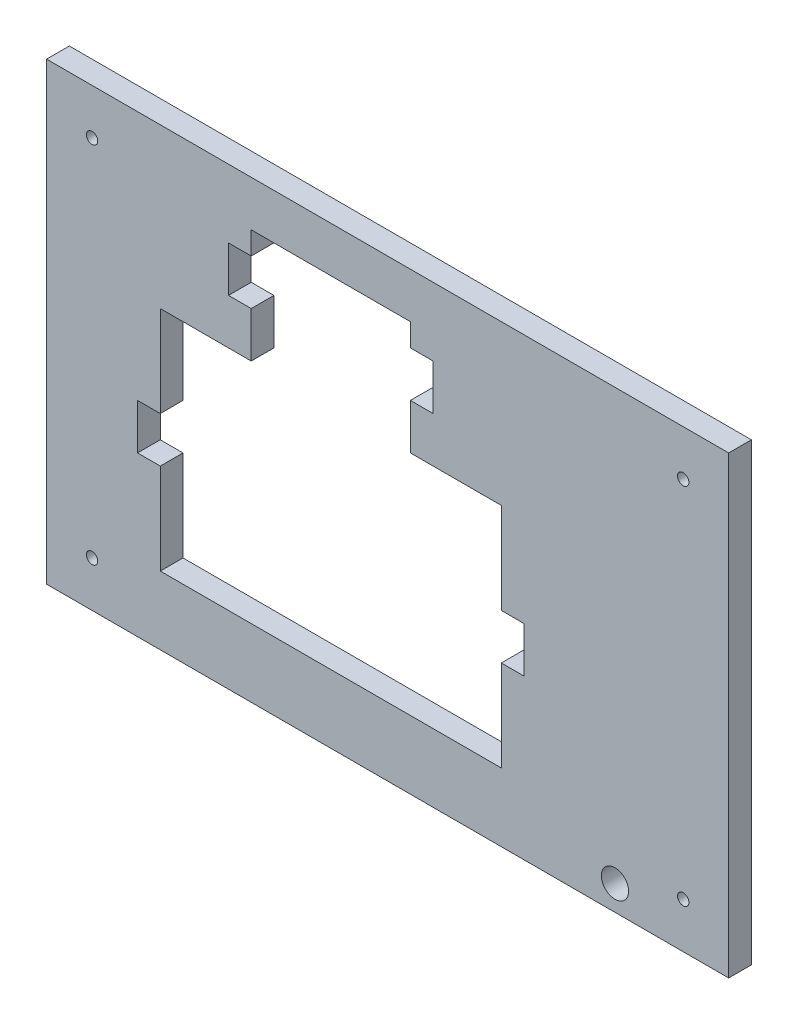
ISO-10303-21;
HEADER;
FILE_DESCRIPTION(('STEP AP214'),'2;1');
FILE_NAME('part.step','',(''),(''),'','','');
FILE_SCHEMA(('AUTOMOTIVE_DESIGN { 1 0 10303 214 1 1 1 1 }'));
ENDSEC;
DATA;
#1=APPLICATION_CONTEXT('core data for automotive mechanical design processes');
#2=APPLICATION_PROTOCOL_DEFINITION('international standard','automotive_design',2000,#1);
#3=PRODUCT_CONTEXT('',#1,'mechanical');
#4=PRODUCT('Part','Part','',(#3));
#5=PRODUCT_RELATED_PRODUCT_CATEGORY('part','',(#4));
#6=PRODUCT_DEFINITION_FORMATION('','',#4);
#7=PRODUCT_DEFINITION_CONTEXT('part definition',#1,'design');
#8=PRODUCT_DEFINITION('design','',#6,#7);
#9=PRODUCT_DEFINITION_SHAPE('','',#8);
#10=(LENGTH_UNIT() NAMED_UNIT(*) SI_UNIT(.MILLI.,.METRE.));
#11=(NAMED_UNIT(*) PLANE_ANGLE_UNIT() SI_UNIT($,.RADIAN.));
#12=(NAMED_UNIT(*) SI_UNIT($,.STERADIAN.) SOLID_ANGLE_UNIT());
#13=UNCERTAINTY_MEASURE_WITH_UNIT(LENGTH_MEASURE(1.E-05),#10,'distance_accuracy_value','');
#14=(GEOMETRIC_REPRESENTATION_CONTEXT(3) GLOBAL_UNCERTAINTY_ASSIGNED_CONTEXT((#13)) GLOBAL_UNIT_ASSIGNED_CONTEXT((#10,
#11,#12)) REPRESENTATION_CONTEXT('',''));
#15=CARTESIAN_POINT('',(0.,0.,0.));
#16=DIRECTION('',(0.,0.,1.));
#17=DIRECTION('',(1.,0.,0.));
#18=AXIS2_PLACEMENT_3D('',#15,#16,#17);
#19=CARTESIAN_POINT('',(0.,0.,-10.));
#20=DIRECTION('',(-1.,0.,0.));
#21=DIRECTION('',(0.,0.,1.));
#22=AXIS2_PLACEMENT_3D('',#19,#20,#21);
#23=PLANE('',#22);
#24=DIRECTION('',(0.,-1.,0.));
#25=VECTOR('',#24,1.);
#26=CARTESIAN_POINT('',(0.,0.,0.));
#27=LINE('',#26,#25);
#28=CARTESIAN_POINT('',(0.,200.,0.));
#29=VERTEX_POINT('',#28);
#30=CARTESIAN_POINT('',(0.,0.,0.));
#31=VERTEX_POINT('',#30);
#32=EDGE_CURVE('E366',#29,#31,#27,.T.);
#33=ORIENTED_EDGE('',*,*,#32,.F.);
#34=DIRECTION('',(0.,0.,1.));
#35=VECTOR('',#34,1.);
#36=CARTESIAN_POINT('',(0.,200.,-10.));
#37=LINE('',#36,#35);
#38=CARTESIAN_POINT('',(0.,200.,-10.));
#39=VERTEX_POINT('',#38);
#40=EDGE_CURVE('E11',#39,#29,#37,.T.);
#41=ORIENTED_EDGE('',*,*,#40,.F.);
#42=DIRECTION('',(0.,-1.,0.));
#43=VECTOR('',#42,1.);
#44=CARTESIAN_POINT('',(0.,0.,-10.));
#45=LINE('',#44,#43);
#46=CARTESIAN_POINT('',(0.,0.,-10.));
#47=VERTEX_POINT('',#46);
#48=EDGE_CURVE('E420',#39,#47,#45,.T.);
#49=ORIENTED_EDGE('',*,*,#48,.T.);
#50=DIRECTION('',(0.,0.,1.));
#51=VECTOR('',#50,1.);
#52=CARTESIAN_POINT('',(0.,0.,-10.));
#53=LINE('',#52,#51);
#54=EDGE_CURVE('E29',#47,#31,#53,.T.);
#55=ORIENTED_EDGE('',*,*,#54,.T.);
#56=EDGE_LOOP('',(#33,#41,#49,#55));
#57=FACE_BOUND('',#56,.T.);
#58=ADVANCED_FACE('F26',(#57),#23,.T.);
#59=CARTESIAN_POINT('',(0.,200.,-10.));
#60=DIRECTION('',(0.,1.,0.));
#61=DIRECTION('',(0.,0.,1.));
#62=AXIS2_PLACEMENT_3D('',#59,#60,#61);
#63=PLANE('',#62);
#64=DIRECTION('',(-1.,0.,0.));
#65=VECTOR('',#64,1.);
#66=CARTESIAN_POINT('',(0.,200.,0.));
#67=LINE('',#66,#65);
#68=CARTESIAN_POINT('',(300.,200.,0.));
#69=VERTEX_POINT('',#68);
#70=EDGE_CURVE('E417',#69,#29,#67,.T.);
#71=ORIENTED_EDGE('',*,*,#70,.F.);
#72=DIRECTION('',(0.,0.,1.));
#73=VECTOR('',#72,1.);
#74=CARTESIAN_POINT('',(300.,200.,-10.));
#75=LINE('',#74,#73);
#76=CARTESIAN_POINT('',(300.,200.,-10.));
#77=VERTEX_POINT('',#76);
#78=EDGE_CURVE('E34',#77,#69,#75,.T.);
#79=ORIENTED_EDGE('',*,*,#78,.F.);
#80=DIRECTION('',(-1.,0.,0.));
#81=VECTOR('',#80,1.);
#82=CARTESIAN_POINT('',(0.,200.,-10.));
#83=LINE('',#82,#81);
#84=EDGE_CURVE('E429',#77,#39,#83,.T.);
#85=ORIENTED_EDGE('',*,*,#84,.T.);
#86=ORIENTED_EDGE('',*,*,#40,.T.);
#87=EDGE_LOOP('',(#71,#79,#85,#86));
#88=FACE_BOUND('',#87,.T.);
#89=ADVANCED_FACE('F443',(#88),#63,.T.);
#90=CARTESIAN_POINT('',(300.,0.,-10.));
#91=DIRECTION('',(1.,0.,0.));
#92=DIRECTION('',(0.,0.,-1.));
#93=AXIS2_PLACEMENT_3D('',#90,#91,#92);
#94=PLANE('',#93);
#95=DIRECTION('',(0.,1.,0.));
#96=VECTOR('',#95,1.);
#97=CARTESIAN_POINT('',(300.,0.,0.));
#98=LINE('',#97,#96);
#99=CARTESIAN_POINT('',(300.,0.,0.));
#100=VERTEX_POINT('',#99);
#101=EDGE_CURVE('E414',#100,#69,#98,.T.);
#102=ORIENTED_EDGE('',*,*,#101,.F.);
#103=DIRECTION('',(0.,0.,1.));
#104=VECTOR('',#103,1.);
#105=CARTESIAN_POINT('',(300.,0.,-10.));
#106=LINE('',#105,#104);
#107=CARTESIAN_POINT('',(300.,0.,-10.));
#108=VERTEX_POINT('',#107);
#109=EDGE_CURVE('E432',#108,#100,#106,.T.);
#110=ORIENTED_EDGE('',*,*,#109,.F.);
#111=DIRECTION('',(0.,1.,0.));
#112=VECTOR('',#111,1.);
#113=CARTESIAN_POINT('',(300.,0.,-10.));
#114=LINE('',#113,#112);
#115=EDGE_CURVE('E426',#108,#77,#114,.T.);
#116=ORIENTED_EDGE('',*,*,#115,.T.);
#117=ORIENTED_EDGE('',*,*,#78,.T.);
#118=EDGE_LOOP('',(#102,#110,#116,#117));
#119=FACE_BOUND('',#118,.T.);
#120=ADVANCED_FACE('F449',(#119),#94,.T.);
#121=CARTESIAN_POINT('',(0.,0.,-10.));
#122=DIRECTION('',(0.,-1.,0.));
#123=DIRECTION('',(0.,0.,-1.));
#124=AXIS2_PLACEMENT_3D('',#121,#122,#123);
#125=PLANE('',#124);
#126=DIRECTION('',(1.,0.,0.));
#127=VECTOR('',#126,1.);
#128=CARTESIAN_POINT('',(0.,0.,0.));
#129=LINE('',#128,#127);
#130=EDGE_CURVE('E411',#31,#100,#129,.T.);
#131=ORIENTED_EDGE('',*,*,#130,.F.);
#132=ORIENTED_EDGE('',*,*,#54,.F.);
#133=DIRECTION('',(1.,0.,0.));
#134=VECTOR('',#133,1.);
#135=CARTESIAN_POINT('',(0.,0.,-10.));
#136=LINE('',#135,#134);
#137=EDGE_CURVE('E423',#47,#108,#136,.T.);
#138=ORIENTED_EDGE('',*,*,#137,.T.);
#139=ORIENTED_EDGE('',*,*,#109,.T.);
#140=EDGE_LOOP('',(#131,#132,#138,#139));
#141=FACE_BOUND('',#140,.T.);
#142=ADVANCED_FACE('F440',(#141),#125,.T.);
#143=CARTESIAN_POINT('',(0.,200.,-10.));
#144=DIRECTION('',(0.,0.,-1.));
#145=DIRECTION('',(-1.,0.,0.));
#146=AXIS2_PLACEMENT_3D('',#143,#144,#145);
#147=PLANE('',#146);
#148=CARTESIAN_POINT('',(250.,11.,-10.));
#149=DIRECTION('',(0.,0.,-1.));
#150=DIRECTION('',(-1.,0.,0.));
#151=AXIS2_PLACEMENT_3D('',#148,#149,#150);
#152=CIRCLE('',#151,6.00000000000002);
#153=CARTESIAN_POINT('',(244.,11.,-10.));
#154=VERTEX_POINT('',#153);
#155=EDGE_CURVE('E719',#154,#154,#152,.T.);
#156=ORIENTED_EDGE('',*,*,#155,.F.);
#157=EDGE_LOOP('',(#156));
#158=FACE_BOUND('',#157,.T.);
#159=CARTESIAN_POINT('',(20.,20.,-10.));
#160=DIRECTION('',(0.,0.,-1.));
#161=DIRECTION('',(-1.,0.,0.));
#162=AXIS2_PLACEMENT_3D('',#159,#160,#161);
#163=CIRCLE('',#162,2.50000000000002);
#164=CARTESIAN_POINT('',(17.4999999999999,20.,-10.));
#165=VERTEX_POINT('',#164);
#166=EDGE_CURVE('E721',#165,#165,#163,.T.);
#167=ORIENTED_EDGE('',*,*,#166,.F.);
#168=EDGE_LOOP('',(#167));
#169=FACE_BOUND('',#168,.T.);
#170=CARTESIAN_POINT('',(20.,180.,-10.));
#171=DIRECTION('',(0.,0.,-1.));
#172=DIRECTION('',(-1.,0.,0.));
#173=AXIS2_PLACEMENT_3D('',#170,#171,#172);
#174=CIRCLE('',#173,2.50000000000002);
#175=CARTESIAN_POINT('',(17.4999999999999,180.,-10.));
#176=VERTEX_POINT('',#175);
#177=EDGE_CURVE('E729',#176,#176,#174,.T.);
#178=ORIENTED_EDGE('',*,*,#177,.F.);
#179=EDGE_LOOP('',(#178));
#180=FACE_BOUND('',#179,.T.);
#181=CARTESIAN_POINT('',(280.,20.,-10.));
#182=DIRECTION('',(0.,0.,-1.));
#183=DIRECTION('',(-1.,0.,0.));
#184=AXIS2_PLACEMENT_3D('',#181,#182,#183);
#185=CIRCLE('',#184,2.50000000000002);
#186=CARTESIAN_POINT('',(277.5,20.,-10.));
#187=VERTEX_POINT('',#186);
#188=EDGE_CURVE('E735',#187,#187,#185,.T.);
#189=ORIENTED_EDGE('',*,*,#188,.F.);
#190=EDGE_LOOP('',(#189));
#191=FACE_BOUND('',#190,.T.);
#192=CARTESIAN_POINT('',(280.,180.,-10.));
#193=DIRECTION('',(0.,0.,-1.));
#194=DIRECTION('',(-1.,0.,0.));
#195=AXIS2_PLACEMENT_3D('',#192,#193,#194);
#196=CIRCLE('',#195,2.50000000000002);
#197=CARTESIAN_POINT('',(277.5,180.,-10.));
#198=VERTEX_POINT('',#197);
#199=EDGE_CURVE('E741',#198,#198,#196,.T.);
#200=ORIENTED_EDGE('',*,*,#199,.F.);
#201=EDGE_LOOP('',(#200));
#202=FACE_BOUND('',#201,.T.);
#203=DIRECTION('',(0.,1.,0.));
#204=VECTOR('',#203,1.);
#205=CARTESIAN_POINT('',(200.,30.,-10.));
#206=LINE('',#205,#204);
#207=CARTESIAN_POINT('',(200.,30.,-10.));
#208=VERTEX_POINT('',#207);
#209=CARTESIAN_POINT('',(200.,70.,-10.));
#210=VERTEX_POINT('',#209);
#211=EDGE_CURVE('E295',#208,#210,#206,.T.);
#212=ORIENTED_EDGE('',*,*,#211,.T.);
#213=DIRECTION('',(1.,0.,0.));
#214=VECTOR('',#213,1.);
#215=CARTESIAN_POINT('',(200.,70.,-10.));
#216=LINE('',#215,#214);
#217=CARTESIAN_POINT('',(210.,70.,-10.));
#218=VERTEX_POINT('',#217);
#219=EDGE_CURVE('E298',#210,#218,#216,.T.);
#220=ORIENTED_EDGE('',*,*,#219,.T.);
#221=DIRECTION('',(0.,1.,0.));
#222=VECTOR('',#221,1.);
#223=CARTESIAN_POINT('',(210.,70.,-10.));
#224=LINE('',#223,#222);
#225=CARTESIAN_POINT('',(210.,90.,-10.));
#226=VERTEX_POINT('',#225);
#227=EDGE_CURVE('E42',#218,#226,#224,.T.);
#228=ORIENTED_EDGE('',*,*,#227,.T.);
#229=DIRECTION('',(-1.,0.,0.));
#230=VECTOR('',#229,1.);
#231=CARTESIAN_POINT('',(210.,90.,-10.));
#232=LINE('',#231,#230);
#233=CARTESIAN_POINT('',(200.,90.,-10.));
#234=VERTEX_POINT('',#233);
#235=EDGE_CURVE('E301',#226,#234,#232,.T.);
#236=ORIENTED_EDGE('',*,*,#235,.T.);
#237=DIRECTION('',(0.,1.,0.));
#238=VECTOR('',#237,1.);
#239=CARTESIAN_POINT('',(200.,90.,-10.));
#240=LINE('',#239,#238);
#241=CARTESIAN_POINT('',(200.,130.,-10.));
#242=VERTEX_POINT('',#241);
#243=EDGE_CURVE('E304',#234,#242,#240,.T.);
#244=ORIENTED_EDGE('',*,*,#243,.T.);
#245=DIRECTION('',(-1.,0.,0.));
#246=VECTOR('',#245,1.);
#247=CARTESIAN_POINT('',(200.,130.,-10.));
#248=LINE('',#247,#246);
#249=CARTESIAN_POINT('',(160.,130.,-10.));
#250=VERTEX_POINT('',#249);
#251=EDGE_CURVE('E307',#242,#250,#248,.T.);
#252=ORIENTED_EDGE('',*,*,#251,.T.);
#253=DIRECTION('',(0.,1.,0.));
#254=VECTOR('',#253,1.);
#255=CARTESIAN_POINT('',(160.,130.,-10.));
#256=LINE('',#255,#254);
#257=CARTESIAN_POINT('',(160.,150.,-10.));
#258=VERTEX_POINT('',#257);
#259=EDGE_CURVE('E310',#250,#258,#256,.T.);
#260=ORIENTED_EDGE('',*,*,#259,.T.);
#261=DIRECTION('',(1.,0.,0.));
#262=VECTOR('',#261,1.);
#263=CARTESIAN_POINT('',(160.,150.,-10.));
#264=LINE('',#263,#262);
#265=CARTESIAN_POINT('',(170.,150.,-10.));
#266=VERTEX_POINT('',#265);
#267=EDGE_CURVE('E313',#258,#266,#264,.T.);
#268=ORIENTED_EDGE('',*,*,#267,.T.);
#269=DIRECTION('',(0.,1.,0.));
#270=VECTOR('',#269,1.);
#271=CARTESIAN_POINT('',(170.,150.,-10.));
#272=LINE('',#271,#270);
#273=CARTESIAN_POINT('',(170.,170.,-10.));
#274=VERTEX_POINT('',#273);
#275=EDGE_CURVE('E316',#266,#274,#272,.T.);
#276=ORIENTED_EDGE('',*,*,#275,.T.);
#277=DIRECTION('',(-1.,0.,0.));
#278=VECTOR('',#277,1.);
#279=CARTESIAN_POINT('',(170.,170.,-10.));
#280=LINE('',#279,#278);
#281=CARTESIAN_POINT('',(160.,170.,-10.));
#282=VERTEX_POINT('',#281);
#283=EDGE_CURVE('E319',#274,#282,#280,.T.);
#284=ORIENTED_EDGE('',*,*,#283,.T.);
#285=DIRECTION('',(0.,1.,0.));
#286=VECTOR('',#285,1.);
#287=CARTESIAN_POINT('',(160.,170.,-10.));
#288=LINE('',#287,#286);
#289=CARTESIAN_POINT('',(160.,180.,-10.));
#290=VERTEX_POINT('',#289);
#291=EDGE_CURVE('E322',#282,#290,#288,.T.);
#292=ORIENTED_EDGE('',*,*,#291,.T.);
#293=DIRECTION('',(-1.,0.,0.));
#294=VECTOR('',#293,1.);
#295=CARTESIAN_POINT('',(160.,180.,-10.));
#296=LINE('',#295,#294);
#297=CARTESIAN_POINT('',(90.,180.,-10.));
#298=VERTEX_POINT('',#297);
#299=EDGE_CURVE('E325',#290,#298,#296,.T.);
#300=ORIENTED_EDGE('',*,*,#299,.T.);
#301=DIRECTION('',(0.,-1.,0.));
#302=VECTOR('',#301,1.);
#303=CARTESIAN_POINT('',(90.,170.,-10.));
#304=LINE('',#303,#302);
#305=CARTESIAN_POINT('',(90.,170.,-10.));
#306=VERTEX_POINT('',#305);
#307=EDGE_CURVE('E328',#298,#306,#304,.T.);
#308=ORIENTED_EDGE('',*,*,#307,.T.);
#309=DIRECTION('',(-1.,0.,0.));
#310=VECTOR('',#309,1.);
#311=CARTESIAN_POINT('',(80.,170.,-10.));
#312=LINE('',#311,#310);
#313=CARTESIAN_POINT('',(80.,170.,-10.));
#314=VERTEX_POINT('',#313);
#315=EDGE_CURVE('E331',#306,#314,#312,.T.);
#316=ORIENTED_EDGE('',*,*,#315,.T.);
#317=DIRECTION('',(0.,-1.,0.));
#318=VECTOR('',#317,1.);
#319=CARTESIAN_POINT('',(80.,150.,-10.));
#320=LINE('',#319,#318);
#321=CARTESIAN_POINT('',(80.,150.,-10.));
#322=VERTEX_POINT('',#321);
#323=EDGE_CURVE('E334',#314,#322,#320,.T.);
#324=ORIENTED_EDGE('',*,*,#323,.T.);
#325=DIRECTION('',(1.,0.,0.));
#326=VECTOR('',#325,1.);
#327=CARTESIAN_POINT('',(90.,150.,-10.));
#328=LINE('',#327,#326);
#329=CARTESIAN_POINT('',(90.,150.,-10.));
#330=VERTEX_POINT('',#329);
#331=EDGE_CURVE('E337',#322,#330,#328,.T.);
#332=ORIENTED_EDGE('',*,*,#331,.T.);
#333=DIRECTION('',(0.,-1.,0.));
#334=VECTOR('',#333,1.);
#335=CARTESIAN_POINT('',(90.,130.,-10.));
#336=LINE('',#335,#334);
#337=CARTESIAN_POINT('',(90.,130.,-10.));
#338=VERTEX_POINT('',#337);
#339=EDGE_CURVE('E340',#330,#338,#336,.T.);
#340=ORIENTED_EDGE('',*,*,#339,.T.);
#341=DIRECTION('',(-1.,0.,0.));
#342=VECTOR('',#341,1.);
#343=CARTESIAN_POINT('',(50.,130.,-10.));
#344=LINE('',#343,#342);
#345=CARTESIAN_POINT('',(50.,130.,-10.));
#346=VERTEX_POINT('',#345);
#347=EDGE_CURVE('E343',#338,#346,#344,.T.);
#348=ORIENTED_EDGE('',*,*,#347,.T.);
#349=DIRECTION('',(0.,-1.,0.));
#350=VECTOR('',#349,1.);
#351=CARTESIAN_POINT('',(50.,90.,-10.));
#352=LINE('',#351,#350);
#353=CARTESIAN_POINT('',(50.,90.,-10.));
#354=VERTEX_POINT('',#353);
#355=EDGE_CURVE('E346',#346,#354,#352,.T.);
#356=ORIENTED_EDGE('',*,*,#355,.T.);
#357=DIRECTION('',(-1.,0.,0.));
#358=VECTOR('',#357,1.);
#359=CARTESIAN_POINT('',(40.,90.,-10.));
#360=LINE('',#359,#358);
#361=CARTESIAN_POINT('',(40.,90.,-10.));
#362=VERTEX_POINT('',#361);
#363=EDGE_CURVE('E349',#354,#362,#360,.T.);
#364=ORIENTED_EDGE('',*,*,#363,.T.);
#365=DIRECTION('',(0.,-1.,0.));
#366=VECTOR('',#365,1.);
#367=CARTESIAN_POINT('',(40.,70.,-10.));
#368=LINE('',#367,#366);
#369=CARTESIAN_POINT('',(40.,70.,-10.));
#370=VERTEX_POINT('',#369);
#371=EDGE_CURVE('E352',#362,#370,#368,.T.);
#372=ORIENTED_EDGE('',*,*,#371,.T.);
#373=DIRECTION('',(1.,0.,0.));
#374=VECTOR('',#373,1.);
#375=CARTESIAN_POINT('',(50.,70.,-10.));
#376=LINE('',#375,#374);
#377=CARTESIAN_POINT('',(50.,70.,-10.));
#378=VERTEX_POINT('',#377);
#379=EDGE_CURVE('E355',#370,#378,#376,.T.);
#380=ORIENTED_EDGE('',*,*,#379,.T.);
#381=DIRECTION('',(0.,-1.,0.));
#382=VECTOR('',#381,1.);
#383=CARTESIAN_POINT('',(50.,30.,-10.));
#384=LINE('',#383,#382);
#385=CARTESIAN_POINT('',(50.,30.,-10.));
#386=VERTEX_POINT('',#385);
#387=EDGE_CURVE('E358',#378,#386,#384,.T.);
#388=ORIENTED_EDGE('',*,*,#387,.T.);
#389=DIRECTION('',(1.,0.,0.));
#390=VECTOR('',#389,1.);
#391=CARTESIAN_POINT('',(50.,30.,-10.));
#392=LINE('',#391,#390);
#393=EDGE_CURVE('E361',#386,#208,#392,.T.);
#394=ORIENTED_EDGE('',*,*,#393,.T.);
#395=EDGE_LOOP('',(#212,#220,#228,#236,#244,#252,#260,#268,#276,#284,#292,#300,#308,#316,#324,
#332,#340,#348,#356,#364,#372,#380,#388,#394));
#396=FACE_BOUND('',#395,.T.);
#397=ORIENTED_EDGE('',*,*,#48,.F.);
#398=ORIENTED_EDGE('',*,*,#84,.F.);
#399=ORIENTED_EDGE('',*,*,#115,.F.);
#400=ORIENTED_EDGE('',*,*,#137,.F.);
#401=EDGE_LOOP('',(#397,#398,#399,#400));
#402=FACE_BOUND('',#401,.T.);
#403=ADVANCED_FACE('F446',(#158,#169,#180,#191,#202,#396,#402),#147,.T.);
#404=CARTESIAN_POINT('',(0.,200.,0.));
#405=DIRECTION('',(0.,0.,-1.));
#406=DIRECTION('',(-1.,0.,0.));
#407=AXIS2_PLACEMENT_3D('',#404,#405,#406);
#408=PLANE('',#407);
#409=CARTESIAN_POINT('',(250.,11.,0.));
#410=DIRECTION('',(0.,0.,-1.));
#411=DIRECTION('',(-1.,0.,0.));
#412=AXIS2_PLACEMENT_3D('',#409,#410,#411);
#413=CIRCLE('',#412,6.00000000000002);
#414=CARTESIAN_POINT('',(244.,11.,0.));
#415=VERTEX_POINT('',#414);
#416=EDGE_CURVE('E716',#415,#415,#413,.T.);
#417=ORIENTED_EDGE('',*,*,#416,.T.);
#418=EDGE_LOOP('',(#417));
#419=FACE_BOUND('',#418,.T.);
#420=CARTESIAN_POINT('',(20.,20.,0.));
#421=DIRECTION('',(0.,0.,-1.));
#422=DIRECTION('',(-1.,0.,0.));
#423=AXIS2_PLACEMENT_3D('',#420,#421,#422);
#424=CIRCLE('',#423,2.50000000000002);
#425=CARTESIAN_POINT('',(17.4999999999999,20.,0.));
#426=VERTEX_POINT('',#425);
#427=EDGE_CURVE('E726',#426,#426,#424,.T.);
#428=ORIENTED_EDGE('',*,*,#427,.T.);
#429=EDGE_LOOP('',(#428));
#430=FACE_BOUND('',#429,.T.);
#431=CARTESIAN_POINT('',(20.,180.,0.));
#432=DIRECTION('',(0.,0.,-1.));
#433=DIRECTION('',(-1.,0.,0.));
#434=AXIS2_PLACEMENT_3D('',#431,#432,#433);
#435=CIRCLE('',#434,2.50000000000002);
#436=CARTESIAN_POINT('',(17.4999999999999,180.,0.));
#437=VERTEX_POINT('',#436);
#438=EDGE_CURVE('E732',#437,#437,#435,.T.);
#439=ORIENTED_EDGE('',*,*,#438,.T.);
#440=EDGE_LOOP('',(#439));
#441=FACE_BOUND('',#440,.T.);
#442=CARTESIAN_POINT('',(280.,20.,0.));
#443=DIRECTION('',(0.,0.,-1.));
#444=DIRECTION('',(-1.,0.,0.));
#445=AXIS2_PLACEMENT_3D('',#442,#443,#444);
#446=CIRCLE('',#445,2.50000000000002);
#447=CARTESIAN_POINT('',(277.5,20.,0.));
#448=VERTEX_POINT('',#447);
#449=EDGE_CURVE('E738',#448,#448,#446,.T.);
#450=ORIENTED_EDGE('',*,*,#449,.T.);
#451=EDGE_LOOP('',(#450));
#452=FACE_BOUND('',#451,.T.);
#453=CARTESIAN_POINT('',(280.,180.,0.));
#454=DIRECTION('',(0.,0.,-1.));
#455=DIRECTION('',(-1.,0.,0.));
#456=AXIS2_PLACEMENT_3D('',#453,#454,#455);
#457=CIRCLE('',#456,2.50000000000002);
#458=CARTESIAN_POINT('',(277.5,180.,0.));
#459=VERTEX_POINT('',#458);
#460=EDGE_CURVE('E744',#459,#459,#457,.T.);
#461=ORIENTED_EDGE('',*,*,#460,.T.);
#462=EDGE_LOOP('',(#461));
#463=FACE_BOUND('',#462,.T.);
#464=DIRECTION('',(1.,0.,0.));
#465=VECTOR('',#464,1.);
#466=CARTESIAN_POINT('',(200.,70.,0.));
#467=LINE('',#466,#465);
#468=CARTESIAN_POINT('',(200.,70.,0.));
#469=VERTEX_POINT('',#468);
#470=CARTESIAN_POINT('',(210.,70.,0.));
#471=VERTEX_POINT('',#470);
#472=EDGE_CURVE('E222',#469,#471,#467,.T.);
#473=ORIENTED_EDGE('',*,*,#472,.F.);
#474=DIRECTION('',(0.,1.,0.));
#475=VECTOR('',#474,1.);
#476=CARTESIAN_POINT('',(200.,30.,0.));
#477=LINE('',#476,#475);
#478=CARTESIAN_POINT('',(200.,30.,0.));
#479=VERTEX_POINT('',#478);
#480=EDGE_CURVE('E50',#479,#469,#477,.T.);
#481=ORIENTED_EDGE('',*,*,#480,.F.);
#482=DIRECTION('',(1.,0.,0.));
#483=VECTOR('',#482,1.);
#484=CARTESIAN_POINT('',(50.,30.,0.));
#485=LINE('',#484,#483);
#486=CARTESIAN_POINT('',(50.,30.,0.));
#487=VERTEX_POINT('',#486);
#488=EDGE_CURVE('E292',#487,#479,#485,.T.);
#489=ORIENTED_EDGE('',*,*,#488,.F.);
#490=DIRECTION('',(0.,-1.,0.));
#491=VECTOR('',#490,1.);
#492=CARTESIAN_POINT('',(50.,30.,0.));
#493=LINE('',#492,#491);
#494=CARTESIAN_POINT('',(50.,70.,0.));
#495=VERTEX_POINT('',#494);
#496=EDGE_CURVE('E289',#495,#487,#493,.T.);
#497=ORIENTED_EDGE('',*,*,#496,.F.);
#498=DIRECTION('',(1.,0.,0.));
#499=VECTOR('',#498,1.);
#500=CARTESIAN_POINT('',(50.,70.,0.));
#501=LINE('',#500,#499);
#502=CARTESIAN_POINT('',(40.,70.,0.));
#503=VERTEX_POINT('',#502);
#504=EDGE_CURVE('E286',#503,#495,#501,.T.);
#505=ORIENTED_EDGE('',*,*,#504,.F.);
#506=DIRECTION('',(0.,-1.,0.));
#507=VECTOR('',#506,1.);
#508=CARTESIAN_POINT('',(40.,70.,0.));
#509=LINE('',#508,#507);
#510=CARTESIAN_POINT('',(40.,90.,0.));
#511=VERTEX_POINT('',#510);
#512=EDGE_CURVE('E283',#511,#503,#509,.T.);
#513=ORIENTED_EDGE('',*,*,#512,.F.);
#514=DIRECTION('',(-1.,0.,0.));
#515=VECTOR('',#514,1.);
#516=CARTESIAN_POINT('',(40.,90.,0.));
#517=LINE('',#516,#515);
#518=CARTESIAN_POINT('',(50.,90.,0.));
#519=VERTEX_POINT('',#518);
#520=EDGE_CURVE('E280',#519,#511,#517,.T.);
#521=ORIENTED_EDGE('',*,*,#520,.F.);
#522=DIRECTION('',(0.,-1.,0.));
#523=VECTOR('',#522,1.);
#524=CARTESIAN_POINT('',(50.,90.,0.));
#525=LINE('',#524,#523);
#526=CARTESIAN_POINT('',(50.,130.,0.));
#527=VERTEX_POINT('',#526);
#528=EDGE_CURVE('E277',#527,#519,#525,.T.);
#529=ORIENTED_EDGE('',*,*,#528,.F.);
#530=DIRECTION('',(-1.,0.,0.));
#531=VECTOR('',#530,1.);
#532=CARTESIAN_POINT('',(50.,130.,0.));
#533=LINE('',#532,#531);
#534=CARTESIAN_POINT('',(90.,130.,0.));
#535=VERTEX_POINT('',#534);
#536=EDGE_CURVE('E274',#535,#527,#533,.T.);
#537=ORIENTED_EDGE('',*,*,#536,.F.);
#538=DIRECTION('',(0.,-1.,0.));
#539=VECTOR('',#538,1.);
#540=CARTESIAN_POINT('',(90.,130.,0.));
#541=LINE('',#540,#539);
#542=CARTESIAN_POINT('',(90.,150.,0.));
#543=VERTEX_POINT('',#542);
#544=EDGE_CURVE('E271',#543,#535,#541,.T.);
#545=ORIENTED_EDGE('',*,*,#544,.F.);
#546=DIRECTION('',(1.,0.,0.));
#547=VECTOR('',#546,1.);
#548=CARTESIAN_POINT('',(90.,150.,0.));
#549=LINE('',#548,#547);
#550=CARTESIAN_POINT('',(80.,150.,0.));
#551=VERTEX_POINT('',#550);
#552=EDGE_CURVE('E268',#551,#543,#549,.T.);
#553=ORIENTED_EDGE('',*,*,#552,.F.);
#554=DIRECTION('',(0.,-1.,0.));
#555=VECTOR('',#554,1.);
#556=CARTESIAN_POINT('',(80.,150.,0.));
#557=LINE('',#556,#555);
#558=CARTESIAN_POINT('',(80.,170.,0.));
#559=VERTEX_POINT('',#558);
#560=EDGE_CURVE('E265',#559,#551,#557,.T.);
#561=ORIENTED_EDGE('',*,*,#560,.F.);
#562=DIRECTION('',(-1.,0.,0.));
#563=VECTOR('',#562,1.);
#564=CARTESIAN_POINT('',(80.,170.,0.));
#565=LINE('',#564,#563);
#566=CARTESIAN_POINT('',(90.,170.,0.));
#567=VERTEX_POINT('',#566);
#568=EDGE_CURVE('E262',#567,#559,#565,.T.);
#569=ORIENTED_EDGE('',*,*,#568,.F.);
#570=DIRECTION('',(0.,-1.,0.));
#571=VECTOR('',#570,1.);
#572=CARTESIAN_POINT('',(90.,170.,0.));
#573=LINE('',#572,#571);
#574=CARTESIAN_POINT('',(90.,180.,0.));
#575=VERTEX_POINT('',#574);
#576=EDGE_CURVE('E259',#575,#567,#573,.T.);
#577=ORIENTED_EDGE('',*,*,#576,.F.);
#578=DIRECTION('',(-1.,0.,0.));
#579=VECTOR('',#578,1.);
#580=CARTESIAN_POINT('',(160.,180.,0.));
#581=LINE('',#580,#579);
#582=CARTESIAN_POINT('',(160.,180.,0.));
#583=VERTEX_POINT('',#582);
#584=EDGE_CURVE('E256',#583,#575,#581,.T.);
#585=ORIENTED_EDGE('',*,*,#584,.F.);
#586=DIRECTION('',(0.,1.,0.));
#587=VECTOR('',#586,1.);
#588=CARTESIAN_POINT('',(160.,170.,0.));
#589=LINE('',#588,#587);
#590=CARTESIAN_POINT('',(160.,170.,0.));
#591=VERTEX_POINT('',#590);
#592=EDGE_CURVE('E253',#591,#583,#589,.T.);
#593=ORIENTED_EDGE('',*,*,#592,.F.);
#594=DIRECTION('',(-1.,0.,0.));
#595=VECTOR('',#594,1.);
#596=CARTESIAN_POINT('',(170.,170.,0.));
#597=LINE('',#596,#595);
#598=CARTESIAN_POINT('',(170.,170.,0.));
#599=VERTEX_POINT('',#598);
#600=EDGE_CURVE('E250',#599,#591,#597,.T.);
#601=ORIENTED_EDGE('',*,*,#600,.F.);
#602=DIRECTION('',(0.,1.,0.));
#603=VECTOR('',#602,1.);
#604=CARTESIAN_POINT('',(170.,150.,0.));
#605=LINE('',#604,#603);
#606=CARTESIAN_POINT('',(170.,150.,0.));
#607=VERTEX_POINT('',#606);
#608=EDGE_CURVE('E247',#607,#599,#605,.T.);
#609=ORIENTED_EDGE('',*,*,#608,.F.);
#610=DIRECTION('',(1.,0.,0.));
#611=VECTOR('',#610,1.);
#612=CARTESIAN_POINT('',(160.,150.,0.));
#613=LINE('',#612,#611);
#614=CARTESIAN_POINT('',(160.,150.,0.));
#615=VERTEX_POINT('',#614);
#616=EDGE_CURVE('E244',#615,#607,#613,.T.);
#617=ORIENTED_EDGE('',*,*,#616,.F.);
#618=DIRECTION('',(0.,1.,0.));
#619=VECTOR('',#618,1.);
#620=CARTESIAN_POINT('',(160.,130.,0.));
#621=LINE('',#620,#619);
#622=CARTESIAN_POINT('',(160.,130.,0.));
#623=VERTEX_POINT('',#622);
#624=EDGE_CURVE('E241',#623,#615,#621,.T.);
#625=ORIENTED_EDGE('',*,*,#624,.F.);
#626=DIRECTION('',(-1.,0.,0.));
#627=VECTOR('',#626,1.);
#628=CARTESIAN_POINT('',(200.,130.,0.));
#629=LINE('',#628,#627);
#630=CARTESIAN_POINT('',(200.,130.,0.));
#631=VERTEX_POINT('',#630);
#632=EDGE_CURVE('E238',#631,#623,#629,.T.);
#633=ORIENTED_EDGE('',*,*,#632,.F.);
#634=DIRECTION('',(0.,1.,0.));
#635=VECTOR('',#634,1.);
#636=CARTESIAN_POINT('',(200.,90.,0.));
#637=LINE('',#636,#635);
#638=CARTESIAN_POINT('',(200.,90.,0.));
#639=VERTEX_POINT('',#638);
#640=EDGE_CURVE('E232',#639,#631,#637,.T.);
#641=ORIENTED_EDGE('',*,*,#640,.F.);
#642=DIRECTION('',(-1.,0.,0.));
#643=VECTOR('',#642,1.);
#644=CARTESIAN_POINT('',(210.,90.,0.));
#645=LINE('',#644,#643);
#646=CARTESIAN_POINT('',(210.,90.,0.));
#647=VERTEX_POINT('',#646);
#648=EDGE_CURVE('E230',#647,#639,#645,.T.);
#649=ORIENTED_EDGE('',*,*,#648,.F.);
#650=DIRECTION('',(0.,1.,0.));
#651=VECTOR('',#650,1.);
#652=CARTESIAN_POINT('',(210.,70.,0.));
#653=LINE('',#652,#651);
#654=EDGE_CURVE('E213',#471,#647,#653,.T.);
#655=ORIENTED_EDGE('',*,*,#654,.F.);
#656=EDGE_LOOP('',(#473,#481,#489,#497,#505,#513,#521,#529,#537,#545,#553,#561,#569,#577,#585,
#593,#601,#609,#617,#625,#633,#641,#649,#655));
#657=FACE_BOUND('',#656,.T.);
#658=ORIENTED_EDGE('',*,*,#32,.T.);
#659=ORIENTED_EDGE('',*,*,#130,.T.);
#660=ORIENTED_EDGE('',*,*,#101,.T.);
#661=ORIENTED_EDGE('',*,*,#70,.T.);
#662=EDGE_LOOP('',(#658,#659,#660,#661));
#663=FACE_BOUND('',#662,.T.);
#664=ADVANCED_FACE('F226',(#419,#430,#441,#452,#463,#657,#663),#408,.F.);
#665=CARTESIAN_POINT('',(200.,30.,-10.));
#666=DIRECTION('',(1.,0.,0.));
#667=DIRECTION('',(0.,0.,-1.));
#668=AXIS2_PLACEMENT_3D('',#665,#666,#667);
#669=PLANE('',#668);
#670=ORIENTED_EDGE('',*,*,#480,.T.);
#671=DIRECTION('',(0.,0.,1.));
#672=VECTOR('',#671,1.);
#673=CARTESIAN_POINT('',(200.,70.,-10.));
#674=LINE('',#673,#672);
#675=EDGE_CURVE('E219',#210,#469,#674,.T.);
#676=ORIENTED_EDGE('',*,*,#675,.F.);
#677=ORIENTED_EDGE('',*,*,#211,.F.);
#678=DIRECTION('',(0.,0.,1.));
#679=VECTOR('',#678,1.);
#680=CARTESIAN_POINT('',(200.,30.,-10.));
#681=LINE('',#680,#679);
#682=EDGE_CURVE('E364',#208,#479,#681,.T.);
#683=ORIENTED_EDGE('',*,*,#682,.T.);
#684=EDGE_LOOP('',(#670,#676,#677,#683));
#685=FACE_BOUND('',#684,.T.);
#686=ADVANCED_FACE('F486',(#685),#669,.F.);
#687=CARTESIAN_POINT('',(50.,30.,-10.));
#688=DIRECTION('',(0.,-1.,0.));
#689=DIRECTION('',(0.,0.,-1.));
#690=AXIS2_PLACEMENT_3D('',#687,#688,#689);
#691=PLANE('',#690);
#692=ORIENTED_EDGE('',*,*,#488,.T.);
#693=ORIENTED_EDGE('',*,*,#682,.F.);
#694=ORIENTED_EDGE('',*,*,#393,.F.);
#695=DIRECTION('',(0.,0.,1.));
#696=VECTOR('',#695,1.);
#697=CARTESIAN_POINT('',(50.,30.,-10.));
#698=LINE('',#697,#696);
#699=EDGE_CURVE('E367',#386,#487,#698,.T.);
#700=ORIENTED_EDGE('',*,*,#699,.T.);
#701=EDGE_LOOP('',(#692,#693,#694,#700));
#702=FACE_BOUND('',#701,.T.);
#703=ADVANCED_FACE('F494',(#702),#691,.F.);
#704=CARTESIAN_POINT('',(50.,30.,-10.));
#705=DIRECTION('',(-1.,0.,0.));
#706=DIRECTION('',(0.,-1.,0.));
#707=AXIS2_PLACEMENT_3D('',#704,#705,#706);
#708=PLANE('',#707);
#709=ORIENTED_EDGE('',*,*,#496,.T.);
#710=ORIENTED_EDGE('',*,*,#699,.F.);
#711=ORIENTED_EDGE('',*,*,#387,.F.);
#712=DIRECTION('',(0.,0.,1.));
#713=VECTOR('',#712,1.);
#714=CARTESIAN_POINT('',(50.,70.,-10.));
#715=LINE('',#714,#713);
#716=EDGE_CURVE('E369',#378,#495,#715,.T.);
#717=ORIENTED_EDGE('',*,*,#716,.T.);
#718=EDGE_LOOP('',(#709,#710,#711,#717));
#719=FACE_BOUND('',#718,.T.);
#720=ADVANCED_FACE('F501',(#719),#708,.F.);
#721=CARTESIAN_POINT('',(50.,70.,-10.));
#722=DIRECTION('',(0.,-1.,0.));
#723=DIRECTION('',(0.,0.,-1.));
#724=AXIS2_PLACEMENT_3D('',#721,#722,#723);
#725=PLANE('',#724);
#726=ORIENTED_EDGE('',*,*,#504,.T.);
#727=ORIENTED_EDGE('',*,*,#716,.F.);
#728=ORIENTED_EDGE('',*,*,#379,.F.);
#729=DIRECTION('',(0.,0.,1.));
#730=VECTOR('',#729,1.);
#731=CARTESIAN_POINT('',(40.,70.,-10.));
#732=LINE('',#731,#730);
#733=EDGE_CURVE('E371',#370,#503,#732,.T.);
#734=ORIENTED_EDGE('',*,*,#733,.T.);
#735=EDGE_LOOP('',(#726,#727,#728,#734));
#736=FACE_BOUND('',#735,.T.);
#737=ADVANCED_FACE('F509',(#736),#725,.F.);
#738=CARTESIAN_POINT('',(40.,70.,-10.));
#739=DIRECTION('',(-1.,0.,0.));
#740=DIRECTION('',(0.,0.,1.));
#741=AXIS2_PLACEMENT_3D('',#738,#739,#740);
#742=PLANE('',#741);
#743=ORIENTED_EDGE('',*,*,#512,.T.);
#744=ORIENTED_EDGE('',*,*,#733,.F.);
#745=ORIENTED_EDGE('',*,*,#371,.F.);
#746=DIRECTION('',(0.,0.,1.));
#747=VECTOR('',#746,1.);
#748=CARTESIAN_POINT('',(40.,90.,-10.));
#749=LINE('',#748,#747);
#750=EDGE_CURVE('E373',#362,#511,#749,.T.);
#751=ORIENTED_EDGE('',*,*,#750,.T.);
#752=EDGE_LOOP('',(#743,#744,#745,#751));
#753=FACE_BOUND('',#752,.T.);
#754=ADVANCED_FACE('F517',(#753),#742,.F.);
#755=CARTESIAN_POINT('',(40.,90.,-10.));
#756=DIRECTION('',(0.,1.,0.));
#757=DIRECTION('',(0.,0.,1.));
#758=AXIS2_PLACEMENT_3D('',#755,#756,#757);
#759=PLANE('',#758);
#760=ORIENTED_EDGE('',*,*,#520,.T.);
#761=ORIENTED_EDGE('',*,*,#750,.F.);
#762=ORIENTED_EDGE('',*,*,#363,.F.);
#763=DIRECTION('',(0.,0.,1.));
#764=VECTOR('',#763,1.);
#765=CARTESIAN_POINT('',(50.,90.,-10.));
#766=LINE('',#765,#764);
#767=EDGE_CURVE('E375',#354,#519,#766,.T.);
#768=ORIENTED_EDGE('',*,*,#767,.T.);
#769=EDGE_LOOP('',(#760,#761,#762,#768));
#770=FACE_BOUND('',#769,.T.);
#771=ADVANCED_FACE('F525',(#770),#759,.F.);
#772=CARTESIAN_POINT('',(50.,90.,-10.));
#773=DIRECTION('',(-1.,0.,0.));
#774=DIRECTION('',(0.,0.,1.));
#775=AXIS2_PLACEMENT_3D('',#772,#773,#774);
#776=PLANE('',#775);
#777=ORIENTED_EDGE('',*,*,#528,.T.);
#778=ORIENTED_EDGE('',*,*,#767,.F.);
#779=ORIENTED_EDGE('',*,*,#355,.F.);
#780=DIRECTION('',(0.,0.,1.));
#781=VECTOR('',#780,1.);
#782=CARTESIAN_POINT('',(50.,130.,-10.));
#783=LINE('',#782,#781);
#784=EDGE_CURVE('E377',#346,#527,#783,.T.);
#785=ORIENTED_EDGE('',*,*,#784,.T.);
#786=EDGE_LOOP('',(#777,#778,#779,#785));
#787=FACE_BOUND('',#786,.T.);
#788=ADVANCED_FACE('F533',(#787),#776,.F.);
#789=CARTESIAN_POINT('',(50.,130.,-10.));
#790=DIRECTION('',(0.,1.,0.));
#791=DIRECTION('',(-1.,0.,0.));
#792=AXIS2_PLACEMENT_3D('',#789,#790,#791);
#793=PLANE('',#792);
#794=ORIENTED_EDGE('',*,*,#536,.T.);
#795=ORIENTED_EDGE('',*,*,#784,.F.);
#796=ORIENTED_EDGE('',*,*,#347,.F.);
#797=DIRECTION('',(0.,0.,1.));
#798=VECTOR('',#797,1.);
#799=CARTESIAN_POINT('',(90.,130.,-10.));
#800=LINE('',#799,#798);
#801=EDGE_CURVE('E379',#338,#535,#800,.T.);
#802=ORIENTED_EDGE('',*,*,#801,.T.);
#803=EDGE_LOOP('',(#794,#795,#796,#802));
#804=FACE_BOUND('',#803,.T.);
#805=ADVANCED_FACE('F541',(#804),#793,.F.);
#806=CARTESIAN_POINT('',(90.,130.,-10.));
#807=DIRECTION('',(-1.,0.,0.));
#808=DIRECTION('',(0.,0.,1.));
#809=AXIS2_PLACEMENT_3D('',#806,#807,#808);
#810=PLANE('',#809);
#811=ORIENTED_EDGE('',*,*,#544,.T.);
#812=ORIENTED_EDGE('',*,*,#801,.F.);
#813=ORIENTED_EDGE('',*,*,#339,.F.);
#814=DIRECTION('',(0.,0.,1.));
#815=VECTOR('',#814,1.);
#816=CARTESIAN_POINT('',(90.,150.,-10.));
#817=LINE('',#816,#815);
#818=EDGE_CURVE('E381',#330,#543,#817,.T.);
#819=ORIENTED_EDGE('',*,*,#818,.T.);
#820=EDGE_LOOP('',(#811,#812,#813,#819));
#821=FACE_BOUND('',#820,.T.);
#822=ADVANCED_FACE('F549',(#821),#810,.F.);
#823=CARTESIAN_POINT('',(90.,150.,-10.));
#824=DIRECTION('',(0.,-1.,0.));
#825=DIRECTION('',(0.,0.,-1.));
#826=AXIS2_PLACEMENT_3D('',#823,#824,#825);
#827=PLANE('',#826);
#828=ORIENTED_EDGE('',*,*,#552,.T.);
#829=ORIENTED_EDGE('',*,*,#818,.F.);
#830=ORIENTED_EDGE('',*,*,#331,.F.);
#831=DIRECTION('',(0.,0.,1.));
#832=VECTOR('',#831,1.);
#833=CARTESIAN_POINT('',(80.,150.,-10.));
#834=LINE('',#833,#832);
#835=EDGE_CURVE('E383',#322,#551,#834,.T.);
#836=ORIENTED_EDGE('',*,*,#835,.T.);
#837=EDGE_LOOP('',(#828,#829,#830,#836));
#838=FACE_BOUND('',#837,.T.);
#839=ADVANCED_FACE('F557',(#838),#827,.F.);
#840=CARTESIAN_POINT('',(80.,150.,-10.));
#841=DIRECTION('',(-1.,0.,0.));
#842=DIRECTION('',(0.,0.,1.));
#843=AXIS2_PLACEMENT_3D('',#840,#841,#842);
#844=PLANE('',#843);
#845=ORIENTED_EDGE('',*,*,#560,.T.);
#846=ORIENTED_EDGE('',*,*,#835,.F.);
#847=ORIENTED_EDGE('',*,*,#323,.F.);
#848=DIRECTION('',(0.,0.,1.));
#849=VECTOR('',#848,1.);
#850=CARTESIAN_POINT('',(80.,170.,-10.));
#851=LINE('',#850,#849);
#852=EDGE_CURVE('E385',#314,#559,#851,.T.);
#853=ORIENTED_EDGE('',*,*,#852,.T.);
#854=EDGE_LOOP('',(#845,#846,#847,#853));
#855=FACE_BOUND('',#854,.T.);
#856=ADVANCED_FACE('F565',(#855),#844,.F.);
#857=CARTESIAN_POINT('',(80.,170.,-10.));
#858=DIRECTION('',(0.,1.,0.));
#859=DIRECTION('',(0.,0.,1.));
#860=AXIS2_PLACEMENT_3D('',#857,#858,#859);
#861=PLANE('',#860);
#862=ORIENTED_EDGE('',*,*,#568,.T.);
#863=ORIENTED_EDGE('',*,*,#852,.F.);
#864=ORIENTED_EDGE('',*,*,#315,.F.);
#865=DIRECTION('',(0.,0.,1.));
#866=VECTOR('',#865,1.);
#867=CARTESIAN_POINT('',(90.,170.,-10.));
#868=LINE('',#867,#866);
#869=EDGE_CURVE('E387',#306,#567,#868,.T.);
#870=ORIENTED_EDGE('',*,*,#869,.T.);
#871=EDGE_LOOP('',(#862,#863,#864,#870));
#872=FACE_BOUND('',#871,.T.);
#873=ADVANCED_FACE('F573',(#872),#861,.F.);
#874=CARTESIAN_POINT('',(90.,170.,-10.));
#875=DIRECTION('',(-1.,0.,0.));
#876=DIRECTION('',(0.,-1.,0.));
#877=AXIS2_PLACEMENT_3D('',#874,#875,#876);
#878=PLANE('',#877);
#879=ORIENTED_EDGE('',*,*,#576,.T.);
#880=ORIENTED_EDGE('',*,*,#869,.F.);
#881=ORIENTED_EDGE('',*,*,#307,.F.);
#882=DIRECTION('',(0.,0.,1.));
#883=VECTOR('',#882,1.);
#884=CARTESIAN_POINT('',(90.,180.,-10.));
#885=LINE('',#884,#883);
#886=EDGE_CURVE('E389',#298,#575,#885,.T.);
#887=ORIENTED_EDGE('',*,*,#886,.T.);
#888=EDGE_LOOP('',(#879,#880,#881,#887));
#889=FACE_BOUND('',#888,.T.);
#890=ADVANCED_FACE('F581',(#889),#878,.F.);
#891=CARTESIAN_POINT('',(160.,180.,-10.));
#892=DIRECTION('',(0.,1.,0.));
#893=DIRECTION('',(0.,0.,1.));
#894=AXIS2_PLACEMENT_3D('',#891,#892,#893);
#895=PLANE('',#894);
#896=ORIENTED_EDGE('',*,*,#584,.T.);
#897=ORIENTED_EDGE('',*,*,#886,.F.);
#898=ORIENTED_EDGE('',*,*,#299,.F.);
#899=DIRECTION('',(0.,0.,1.));
#900=VECTOR('',#899,1.);
#901=CARTESIAN_POINT('',(160.,180.,-10.));
#902=LINE('',#901,#900);
#903=EDGE_CURVE('E391',#290,#583,#902,.T.);
#904=ORIENTED_EDGE('',*,*,#903,.T.);
#905=EDGE_LOOP('',(#896,#897,#898,#904));
#906=FACE_BOUND('',#905,.T.);
#907=ADVANCED_FACE('F589',(#906),#895,.F.);
#908=CARTESIAN_POINT('',(160.,170.,-10.));
#909=DIRECTION('',(1.,0.,0.));
#910=DIRECTION('',(0.,1.,0.));
#911=AXIS2_PLACEMENT_3D('',#908,#909,#910);
#912=PLANE('',#911);
#913=ORIENTED_EDGE('',*,*,#592,.T.);
#914=ORIENTED_EDGE('',*,*,#903,.F.);
#915=ORIENTED_EDGE('',*,*,#291,.F.);
#916=DIRECTION('',(0.,0.,1.));
#917=VECTOR('',#916,1.);
#918=CARTESIAN_POINT('',(160.,170.,-10.));
#919=LINE('',#918,#917);
#920=EDGE_CURVE('E393',#282,#591,#919,.T.);
#921=ORIENTED_EDGE('',*,*,#920,.T.);
#922=EDGE_LOOP('',(#913,#914,#915,#921));
#923=FACE_BOUND('',#922,.T.);
#924=ADVANCED_FACE('F597',(#923),#912,.F.);
#925=CARTESIAN_POINT('',(170.,170.,-10.));
#926=DIRECTION('',(0.,1.,0.));
#927=DIRECTION('',(0.,0.,1.));
#928=AXIS2_PLACEMENT_3D('',#925,#926,#927);
#929=PLANE('',#928);
#930=ORIENTED_EDGE('',*,*,#600,.T.);
#931=ORIENTED_EDGE('',*,*,#920,.F.);
#932=ORIENTED_EDGE('',*,*,#283,.F.);
#933=DIRECTION('',(0.,0.,1.));
#934=VECTOR('',#933,1.);
#935=CARTESIAN_POINT('',(170.,170.,-10.));
#936=LINE('',#935,#934);
#937=EDGE_CURVE('E395',#274,#599,#936,.T.);
#938=ORIENTED_EDGE('',*,*,#937,.T.);
#939=EDGE_LOOP('',(#930,#931,#932,#938));
#940=FACE_BOUND('',#939,.T.);
#941=ADVANCED_FACE('F605',(#940),#929,.F.);
#942=CARTESIAN_POINT('',(170.,150.,-10.));
#943=DIRECTION('',(1.,0.,0.));
#944=DIRECTION('',(0.,0.,-1.));
#945=AXIS2_PLACEMENT_3D('',#942,#943,#944);
#946=PLANE('',#945);
#947=ORIENTED_EDGE('',*,*,#608,.T.);
#948=ORIENTED_EDGE('',*,*,#937,.F.);
#949=ORIENTED_EDGE('',*,*,#275,.F.);
#950=DIRECTION('',(0.,0.,1.));
#951=VECTOR('',#950,1.);
#952=CARTESIAN_POINT('',(170.,150.,-10.));
#953=LINE('',#952,#951);
#954=EDGE_CURVE('E397',#266,#607,#953,.T.);
#955=ORIENTED_EDGE('',*,*,#954,.T.);
#956=EDGE_LOOP('',(#947,#948,#949,#955));
#957=FACE_BOUND('',#956,.T.);
#958=ADVANCED_FACE('F613',(#957),#946,.F.);
#959=CARTESIAN_POINT('',(160.,150.,-10.));
#960=DIRECTION('',(0.,-1.,0.));
#961=DIRECTION('',(0.,0.,-1.));
#962=AXIS2_PLACEMENT_3D('',#959,#960,#961);
#963=PLANE('',#962);
#964=ORIENTED_EDGE('',*,*,#616,.T.);
#965=ORIENTED_EDGE('',*,*,#954,.F.);
#966=ORIENTED_EDGE('',*,*,#267,.F.);
#967=DIRECTION('',(0.,0.,1.));
#968=VECTOR('',#967,1.);
#969=CARTESIAN_POINT('',(160.,150.,-10.));
#970=LINE('',#969,#968);
#971=EDGE_CURVE('E399',#258,#615,#970,.T.);
#972=ORIENTED_EDGE('',*,*,#971,.T.);
#973=EDGE_LOOP('',(#964,#965,#966,#972));
#974=FACE_BOUND('',#973,.T.);
#975=ADVANCED_FACE('F621',(#974),#963,.F.);
#976=CARTESIAN_POINT('',(160.,130.,-10.));
#977=DIRECTION('',(1.,0.,0.));
#978=DIRECTION('',(0.,0.,-1.));
#979=AXIS2_PLACEMENT_3D('',#976,#977,#978);
#980=PLANE('',#979);
#981=ORIENTED_EDGE('',*,*,#624,.T.);
#982=ORIENTED_EDGE('',*,*,#971,.F.);
#983=ORIENTED_EDGE('',*,*,#259,.F.);
#984=DIRECTION('',(0.,0.,1.));
#985=VECTOR('',#984,1.);
#986=CARTESIAN_POINT('',(160.,130.,-10.));
#987=LINE('',#986,#985);
#988=EDGE_CURVE('E401',#250,#623,#987,.T.);
#989=ORIENTED_EDGE('',*,*,#988,.T.);
#990=EDGE_LOOP('',(#981,#982,#983,#989));
#991=FACE_BOUND('',#990,.T.);
#992=ADVANCED_FACE('F629',(#991),#980,.F.);
#993=CARTESIAN_POINT('',(200.,130.,-10.));
#994=DIRECTION('',(0.,1.,0.));
#995=DIRECTION('',(0.,0.,1.));
#996=AXIS2_PLACEMENT_3D('',#993,#994,#995);
#997=PLANE('',#996);
#998=ORIENTED_EDGE('',*,*,#632,.T.);
#999=ORIENTED_EDGE('',*,*,#988,.F.);
#1000=ORIENTED_EDGE('',*,*,#251,.F.);
#1001=DIRECTION('',(0.,0.,1.));
#1002=VECTOR('',#1001,1.);
#1003=CARTESIAN_POINT('',(200.,130.,-10.));
#1004=LINE('',#1003,#1002);
#1005=EDGE_CURVE('E403',#242,#631,#1004,.T.);
#1006=ORIENTED_EDGE('',*,*,#1005,.T.);
#1007=EDGE_LOOP('',(#998,#999,#1000,#1006));
#1008=FACE_BOUND('',#1007,.T.);
#1009=ADVANCED_FACE('F637',(#1008),#997,.F.);
#1010=CARTESIAN_POINT('',(200.,90.,-10.));
#1011=DIRECTION('',(1.,0.,0.));
#1012=DIRECTION('',(0.,0.,-1.));
#1013=AXIS2_PLACEMENT_3D('',#1010,#1011,#1012);
#1014=PLANE('',#1013);
#1015=ORIENTED_EDGE('',*,*,#640,.T.);
#1016=ORIENTED_EDGE('',*,*,#1005,.F.);
#1017=ORIENTED_EDGE('',*,*,#243,.F.);
#1018=DIRECTION('',(0.,0.,1.));
#1019=VECTOR('',#1018,1.);
#1020=CARTESIAN_POINT('',(200.,90.,-10.));
#1021=LINE('',#1020,#1019);
#1022=EDGE_CURVE('E405',#234,#639,#1021,.T.);
#1023=ORIENTED_EDGE('',*,*,#1022,.T.);
#1024=EDGE_LOOP('',(#1015,#1016,#1017,#1023));
#1025=FACE_BOUND('',#1024,.T.);
#1026=ADVANCED_FACE('F645',(#1025),#1014,.F.);
#1027=CARTESIAN_POINT('',(210.,90.,-10.));
#1028=DIRECTION('',(0.,1.,0.));
#1029=DIRECTION('',(0.,0.,1.));
#1030=AXIS2_PLACEMENT_3D('',#1027,#1028,#1029);
#1031=PLANE('',#1030);
#1032=ORIENTED_EDGE('',*,*,#648,.T.);
#1033=ORIENTED_EDGE('',*,*,#1022,.F.);
#1034=ORIENTED_EDGE('',*,*,#235,.F.);
#1035=DIRECTION('',(0.,0.,1.));
#1036=VECTOR('',#1035,1.);
#1037=CARTESIAN_POINT('',(210.,90.,-10.));
#1038=LINE('',#1037,#1036);
#1039=EDGE_CURVE('E218',#226,#647,#1038,.T.);
#1040=ORIENTED_EDGE('',*,*,#1039,.T.);
#1041=EDGE_LOOP('',(#1032,#1033,#1034,#1040));
#1042=FACE_BOUND('',#1041,.T.);
#1043=ADVANCED_FACE('F653',(#1042),#1031,.F.);
#1044=CARTESIAN_POINT('',(210.,70.,-10.));
#1045=DIRECTION('',(1.,0.,0.));
#1046=DIRECTION('',(0.,0.,-1.));
#1047=AXIS2_PLACEMENT_3D('',#1044,#1045,#1046);
#1048=PLANE('',#1047);
#1049=ORIENTED_EDGE('',*,*,#654,.T.);
#1050=ORIENTED_EDGE('',*,*,#1039,.F.);
#1051=ORIENTED_EDGE('',*,*,#227,.F.);
#1052=DIRECTION('',(0.,0.,1.));
#1053=VECTOR('',#1052,1.);
#1054=CARTESIAN_POINT('',(210.,70.,-10.));
#1055=LINE('',#1054,#1053);
#1056=EDGE_CURVE('E209',#218,#471,#1055,.T.);
#1057=ORIENTED_EDGE('',*,*,#1056,.T.);
#1058=EDGE_LOOP('',(#1049,#1050,#1051,#1057));
#1059=FACE_BOUND('',#1058,.T.);
#1060=ADVANCED_FACE('F211',(#1059),#1048,.F.);
#1061=CARTESIAN_POINT('',(200.,70.,-10.));
#1062=DIRECTION('',(0.,-1.,0.));
#1063=DIRECTION('',(0.,0.,-1.));
#1064=AXIS2_PLACEMENT_3D('',#1061,#1062,#1063);
#1065=PLANE('',#1064);
#1066=ORIENTED_EDGE('',*,*,#472,.T.);
#1067=ORIENTED_EDGE('',*,*,#1056,.F.);
#1068=ORIENTED_EDGE('',*,*,#219,.F.);
#1069=ORIENTED_EDGE('',*,*,#675,.T.);
#1070=EDGE_LOOP('',(#1066,#1067,#1068,#1069));
#1071=FACE_BOUND('',#1070,.T.);
#1072=ADVANCED_FACE('F223',(#1071),#1065,.F.);
#1073=CARTESIAN_POINT('',(280.,180.,0.));
#1074=DIRECTION('',(0.,0.,-1.));
#1075=DIRECTION('',(-1.,0.,0.));
#1076=AXIS2_PLACEMENT_3D('',#1073,#1074,#1075);
#1077=CYLINDRICAL_SURFACE('',#1076,2.50000000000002);
#1078=ORIENTED_EDGE('',*,*,#460,.F.);
#1079=EDGE_LOOP('',(#1078));
#1080=FACE_BOUND('',#1079,.T.);
#1081=ORIENTED_EDGE('',*,*,#199,.T.);
#1082=EDGE_LOOP('',(#1081));
#1083=FACE_BOUND('',#1082,.T.);
#1084=ADVANCED_FACE('F674',(#1080,#1083),#1077,.F.);
#1085=CARTESIAN_POINT('',(280.,20.,0.));
#1086=DIRECTION('',(0.,0.,-1.));
#1087=DIRECTION('',(-1.,0.,0.));
#1088=AXIS2_PLACEMENT_3D('',#1085,#1086,#1087);
#1089=CYLINDRICAL_SURFACE('',#1088,2.50000000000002);
#1090=ORIENTED_EDGE('',*,*,#449,.F.);
#1091=EDGE_LOOP('',(#1090));
#1092=FACE_BOUND('',#1091,.T.);
#1093=ORIENTED_EDGE('',*,*,#188,.T.);
#1094=EDGE_LOOP('',(#1093));
#1095=FACE_BOUND('',#1094,.T.);
#1096=ADVANCED_FACE('F681',(#1092,#1095),#1089,.F.);
#1097=CARTESIAN_POINT('',(20.,180.,0.));
#1098=DIRECTION('',(0.,0.,-1.));
#1099=DIRECTION('',(-1.,0.,0.));
#1100=AXIS2_PLACEMENT_3D('',#1097,#1098,#1099);
#1101=CYLINDRICAL_SURFACE('',#1100,2.50000000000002);
#1102=ORIENTED_EDGE('',*,*,#438,.F.);
#1103=EDGE_LOOP('',(#1102));
#1104=FACE_BOUND('',#1103,.T.);
#1105=ORIENTED_EDGE('',*,*,#177,.T.);
#1106=EDGE_LOOP('',(#1105));
#1107=FACE_BOUND('',#1106,.T.);
#1108=ADVANCED_FACE('F689',(#1104,#1107),#1101,.F.);
#1109=CARTESIAN_POINT('',(20.,20.,0.));
#1110=DIRECTION('',(0.,0.,-1.));
#1111=DIRECTION('',(-1.,0.,0.));
#1112=AXIS2_PLACEMENT_3D('',#1109,#1110,#1111);
#1113=CYLINDRICAL_SURFACE('',#1112,2.50000000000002);
#1114=ORIENTED_EDGE('',*,*,#427,.F.);
#1115=EDGE_LOOP('',(#1114));
#1116=FACE_BOUND('',#1115,.T.);
#1117=ORIENTED_EDGE('',*,*,#166,.T.);
#1118=EDGE_LOOP('',(#1117));
#1119=FACE_BOUND('',#1118,.T.);
#1120=ADVANCED_FACE('F697',(#1116,#1119),#1113,.F.);
#1121=CARTESIAN_POINT('',(250.,11.,0.));
#1122=DIRECTION('',(0.,0.,-1.));
#1123=DIRECTION('',(-1.,0.,0.));
#1124=AXIS2_PLACEMENT_3D('',#1121,#1122,#1123);
#1125=CYLINDRICAL_SURFACE('',#1124,6.00000000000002);
#1126=ORIENTED_EDGE('',*,*,#416,.F.);
#1127=EDGE_LOOP('',(#1126));
#1128=FACE_BOUND('',#1127,.T.);
#1129=ORIENTED_EDGE('',*,*,#155,.T.);
#1130=EDGE_LOOP('',(#1129));
#1131=FACE_BOUND('',#1130,.T.);
#1132=ADVANCED_FACE('F704',(#1128,#1131),#1125,.F.);
#1133=CLOSED_SHELL('',(#58,#89,#120,#142,#403,#664,#686,#703,#720,#737,#754,#771,#788,#805,#822,
#839,#856,#873,#890,#907,#924,#941,#958,#975,#992,#1009,#1026,#1043,#1060,#1072,#1084,#1096,
#1108,#1120,#1132));
#1134=MANIFOLD_SOLID_BREP('B2',#1133);
#1135=ADVANCED_BREP_SHAPE_REPRESENTATION('',(#18,#1134),#14);
#1136=SHAPE_DEFINITION_REPRESENTATION(#9,#1135);
ENDSEC;
END-ISO-10303-21;
